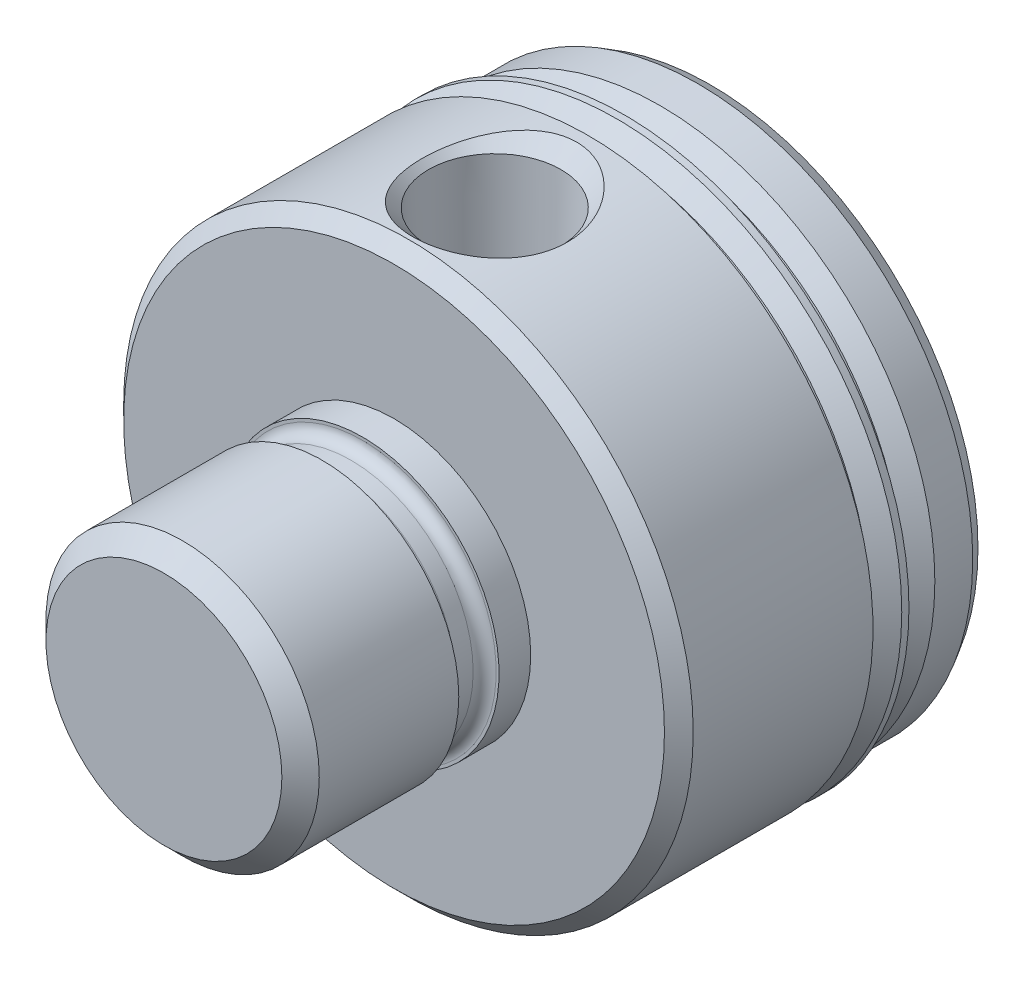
ISO-10303-21;
HEADER;
FILE_DESCRIPTION(('STEP AP214'),'2;1');
FILE_NAME('part.step','',(''),(''),'','','');
FILE_SCHEMA(('AUTOMOTIVE_DESIGN { 1 0 10303 214 1 1 1 1 }'));
ENDSEC;
DATA;
#1=APPLICATION_CONTEXT('core data for automotive mechanical design processes');
#2=APPLICATION_PROTOCOL_DEFINITION('international standard','automotive_design',2000,#1);
#3=PRODUCT_CONTEXT('',#1,'mechanical');
#4=PRODUCT('Part','Part','',(#3));
#5=PRODUCT_RELATED_PRODUCT_CATEGORY('part','',(#4));
#6=PRODUCT_DEFINITION_FORMATION('','',#4);
#7=PRODUCT_DEFINITION_CONTEXT('part definition',#1,'design');
#8=PRODUCT_DEFINITION('design','',#6,#7);
#9=PRODUCT_DEFINITION_SHAPE('','',#8);
#10=(LENGTH_UNIT() NAMED_UNIT(*) SI_UNIT(.MILLI.,.METRE.));
#11=(NAMED_UNIT(*) PLANE_ANGLE_UNIT() SI_UNIT($,.RADIAN.));
#12=(NAMED_UNIT(*) SI_UNIT($,.STERADIAN.) SOLID_ANGLE_UNIT());
#13=UNCERTAINTY_MEASURE_WITH_UNIT(LENGTH_MEASURE(1.E-05),#10,'distance_accuracy_value','');
#14=(GEOMETRIC_REPRESENTATION_CONTEXT(3) GLOBAL_UNCERTAINTY_ASSIGNED_CONTEXT((#13)) GLOBAL_UNIT_ASSIGNED_CONTEXT((#10,
#11,#12)) REPRESENTATION_CONTEXT('',''));
#15=CARTESIAN_POINT('',(0.,0.,0.));
#16=DIRECTION('',(0.,0.,1.));
#17=DIRECTION('',(1.,0.,0.));
#18=AXIS2_PLACEMENT_3D('',#15,#16,#17);
#19=CARTESIAN_POINT('',(0.,0.,22.));
#20=DIRECTION('',(0.,0.,-1.));
#21=DIRECTION('',(-1.,0.,0.));
#22=AXIS2_PLACEMENT_3D('',#19,#20,#21);
#23=CYLINDRICAL_SURFACE('',#22,19.8);
#24=CARTESIAN_POINT('',(0.,0.,21.));
#25=DIRECTION('',(0.,0.,1.));
#26=DIRECTION('',(1.,0.,0.));
#27=AXIS2_PLACEMENT_3D('',#24,#25,#26);
#28=CIRCLE('',#27,19.8);
#29=CARTESIAN_POINT('',(19.8,0.,21.));
#30=VERTEX_POINT('',#29);
#31=EDGE_CURVE('E75',#30,#30,#28,.F.);
#32=ORIENTED_EDGE('',*,*,#31,.T.);
#33=EDGE_LOOP('',(#32));
#34=FACE_BOUND('',#33,.T.);
#35=CARTESIAN_POINT('',(-4.23456118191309,19.341884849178,11.9103654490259));
#36=CARTESIAN_POINT('',(-4.07687664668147,19.3764070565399,11.6356817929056));
#37=CARTESIAN_POINT('',(-3.89702266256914,19.4137865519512,11.3739567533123));
#38=CARTESIAN_POINT('',(-3.49532950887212,19.4901095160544,10.8848210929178));
#39=CARTESIAN_POINT('',(-3.27346972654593,19.5290537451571,10.6574274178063));
#40=CARTESIAN_POINT('',(-2.79297257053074,19.6035193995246,10.2475499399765));
#41=CARTESIAN_POINT('',(-2.53455082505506,19.6390589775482,10.0648188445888));
#42=CARTESIAN_POINT('',(-1.98643303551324,19.7020226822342,9.75262714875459));
#43=CARTESIAN_POINT('',(-1.69677662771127,19.7294569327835,9.62310001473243));
#44=CARTESIAN_POINT('',(-1.13565186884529,19.7691365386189,9.43901851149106));
#45=CARTESIAN_POINT('',(-0.86678525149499,19.7829027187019,9.37685588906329));
#46=CARTESIAN_POINT('',(-0.321914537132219,19.7992522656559,9.30323045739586));
#47=CARTESIAN_POINT('',(-0.0459160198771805,19.8018441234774,9.2917291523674));
#48=CARTESIAN_POINT('',(0.474663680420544,19.795844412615,9.31861467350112));
#49=CARTESIAN_POINT('',(0.719536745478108,19.7883839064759,9.35195529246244));
#50=CARTESIAN_POINT('',(1.20011845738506,19.7650599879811,9.45806650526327));
#51=CARTESIAN_POINT('',(1.43582699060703,19.7491964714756,9.53083758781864));
#52=CARTESIAN_POINT('',(1.89433897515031,19.710529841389,9.71316702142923));
#53=CARTESIAN_POINT('',(2.11700503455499,19.6876647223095,9.82305501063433));
#54=CARTESIAN_POINT('',(2.54270663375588,19.6372267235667,10.0749502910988));
#55=CARTESIAN_POINT('',(2.74573573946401,19.609652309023,10.216968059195));
#56=CARTESIAN_POINT('',(3.14866109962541,19.5492098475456,10.5443432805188));
#57=CARTESIAN_POINT('',(3.34612297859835,19.516088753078,10.7326446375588));
#58=CARTESIAN_POINT('',(3.71078746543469,19.4500505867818,11.1365638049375));
#59=CARTESIAN_POINT('',(3.87797475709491,19.4171336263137,11.3521953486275));
#60=CARTESIAN_POINT('',(4.19953341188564,19.350304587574,11.8341579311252));
#61=CARTESIAN_POINT('',(4.34956148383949,19.3167995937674,12.1034484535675));
#62=CARTESIAN_POINT('',(4.60700813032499,19.2570239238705,12.6624255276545));
#63=CARTESIAN_POINT('',(4.71440976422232,19.2307561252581,12.9521201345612));
#64=CARTESIAN_POINT('',(4.8927078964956,19.1862110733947,13.5707534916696));
#65=CARTESIAN_POINT('',(4.95961440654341,19.1688280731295,13.9009135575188));
#66=CARTESIAN_POINT('',(5.04043159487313,19.1477359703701,14.5680906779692));
#67=CARTESIAN_POINT('',(5.05433347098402,19.144029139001,14.9051088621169));
#68=CARTESIAN_POINT('',(5.0285381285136,19.1508230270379,15.586654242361));
#69=CARTESIAN_POINT('',(4.98729522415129,19.1617334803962,15.9311202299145));
#70=CARTESIAN_POINT('',(4.84914881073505,19.1971555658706,16.6080519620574));
#71=CARTESIAN_POINT('',(4.75223634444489,19.2216693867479,16.9405157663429));
#72=CARTESIAN_POINT('',(4.50449080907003,19.2812266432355,17.5830524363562));
#73=CARTESIAN_POINT('',(4.35375852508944,19.3162503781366,17.8931658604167));
#74=CARTESIAN_POINT('',(4.0005180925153,19.3924832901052,18.4817494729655));
#75=CARTESIAN_POINT('',(3.79800693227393,19.433692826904,18.7602178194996));
#76=CARTESIAN_POINT('',(3.35421628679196,19.5150659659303,19.2636047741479));
#77=CARTESIAN_POINT('',(3.11495938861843,19.5551991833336,19.490301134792));
#78=CARTESIAN_POINT('',(2.59696129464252,19.6306906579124,19.8939270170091));
#79=CARTESIAN_POINT('',(2.31826241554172,19.6660539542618,20.0709092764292));
#80=CARTESIAN_POINT('',(1.76371813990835,19.7230146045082,20.3470656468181));
#81=CARTESIAN_POINT('',(1.49136009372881,19.7457390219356,20.452924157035));
#82=CARTESIAN_POINT('',(1.07133873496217,19.7714966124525,20.5712905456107));
#83=CARTESIAN_POINT('',(0.929406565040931,19.7786945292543,20.6040100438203));
#84=CARTESIAN_POINT('',(0.642926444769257,19.7900781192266,20.6555086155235));
#85=CARTESIAN_POINT('',(0.498378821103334,19.7942641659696,20.6742894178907));
#86=CARTESIAN_POINT('',(0.100595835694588,19.8013478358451,20.7060741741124));
#87=CARTESIAN_POINT('',(-0.154016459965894,19.8010070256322,20.7045515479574));
#88=CARTESIAN_POINT('',(-0.65884841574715,19.7906493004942,20.658066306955));
#89=CARTESIAN_POINT('',(-0.90906884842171,19.7806341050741,20.613111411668));
#90=CARTESIAN_POINT('',(-1.38927726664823,19.7526136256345,20.4846446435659));
#91=CARTESIAN_POINT('',(-1.61966828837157,19.7349050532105,20.4025603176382));
#92=CARTESIAN_POINT('',(-2.06448483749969,19.6933464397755,20.2040719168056));
#93=CARTESIAN_POINT('',(-2.27890688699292,19.669495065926,20.0876603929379));
#94=CARTESIAN_POINT('',(-2.70317102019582,19.6158602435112,19.8150829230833));
#95=CARTESIAN_POINT('',(-2.91148061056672,19.5857671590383,19.6566006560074));
#96=CARTESIAN_POINT('',(-3.3019879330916,19.5237305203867,19.3105587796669));
#97=CARTESIAN_POINT('',(-3.48417329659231,19.4917860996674,19.1229854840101));
#98=CARTESIAN_POINT('',(-3.84155983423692,19.4247157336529,18.698657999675));
#99=CARTESIAN_POINT('',(-4.01296031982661,19.3896986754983,18.4586839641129));
#100=CARTESIAN_POINT('',(-4.31782342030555,19.3240978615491,17.9552040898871));
#101=CARTESIAN_POINT('',(-4.45126908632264,19.2935160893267,17.6916878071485));
#102=CARTESIAN_POINT('',(-4.6909794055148,19.2367249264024,17.1181094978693));
#103=CARTESIAN_POINT('',(-4.79277456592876,19.2113400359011,16.8060900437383));
#104=CARTESIAN_POINT('',(-4.94654548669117,19.1723237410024,16.1692507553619));
#105=CARTESIAN_POINT('',(-4.9985027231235,19.1586967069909,15.844426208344));
#106=CARTESIAN_POINT('',(-5.05307244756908,19.1443820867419,15.174535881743));
#107=CARTESIAN_POINT('',(-5.05318210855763,19.144350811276,14.8292498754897));
#108=CARTESIAN_POINT('',(-4.99772462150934,19.1589032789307,14.1436098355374));
#109=CARTESIAN_POINT('',(-4.94218495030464,19.1734798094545,13.8032534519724));
#110=CARTESIAN_POINT('',(-4.79136155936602,19.2116525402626,13.1969593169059));
#111=CARTESIAN_POINT('',(-4.70500571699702,19.2331590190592,12.9286332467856));
#112=CARTESIAN_POINT('',(-4.49641280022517,19.2829921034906,12.4069406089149));
#113=CARTESIAN_POINT('',(-4.37417690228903,19.3113184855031,12.1535735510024));
#114=CARTESIAN_POINT('',(-4.23456118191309,19.341884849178,11.9103654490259));
#115=B_SPLINE_CURVE_WITH_KNOTS('',3,(#35,#36,#37,#38,#39,#40,#41,#42,#43,#44,#45,#46,#47,#48,
#49,#50,#51,#52,#53,#54,#55,#56,#57,#58,#59,#60,#61,#62,#63,#64,#65,#66,#67,#68,#69,#70,#71,#72,
#73,#74,#75,#76,#77,#78,#79,#80,#81,#82,#83,#84,#85,#86,#87,#88,#89,#90,#91,#92,#93,#94,#95,#96,
#97,#98,#99,#100,#101,#102,#103,#104,#105,#106,#107,#108,#109,#110,#111,#112,#113,#114),
.UNSPECIFIED.,.T.,.F.,(4,2,2,2,2,2,2,2,2,2,2,2,2,2,2,2,2,2,2,2,2,2,2,2,2,2,2,2,2,2,2,2,2,2,2,2,
2,2,2,4),(0.,0.954854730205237,1.91017923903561,2.86008786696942,3.80880495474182,
4.63301716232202,5.45660297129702,6.19484379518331,6.93309376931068,7.67808055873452,
8.42331062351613,9.24459612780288,10.0662959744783,10.9926353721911,11.9193425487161,
12.926692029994,13.9342087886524,14.9705660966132,16.0070902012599,17.0416833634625,
18.0763367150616,19.0668483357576,20.05630519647,20.9298988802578,21.3667608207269,
21.803568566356,22.5631889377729,23.3226743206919,24.0551594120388,24.7878035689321,
25.5750535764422,26.3626750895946,27.2499576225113,28.1376357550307,29.1208250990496,
30.1043797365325,31.135408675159,32.1659287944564,33.0113959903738,33.8568354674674),.UNSPECIFIED.);
#116=CARTESIAN_POINT('',(-4.23456118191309,19.341884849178,11.9103654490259));
#117=VERTEX_POINT('',#116);
#118=EDGE_CURVE('E51',#117,#117,#115,.T.);
#119=ORIENTED_EDGE('',*,*,#118,.T.);
#120=EDGE_LOOP('',(#119));
#121=FACE_BOUND('',#120,.T.);
#122=CARTESIAN_POINT('',(0.,0.,8.50000000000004));
#123=DIRECTION('',(0.,0.,-1.));
#124=DIRECTION('',(-1.,0.,0.));
#125=AXIS2_PLACEMENT_3D('',#122,#123,#124);
#126=CIRCLE('',#125,19.8);
#127=CARTESIAN_POINT('',(-19.8,0.,8.50000000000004));
#128=VERTEX_POINT('',#127);
#129=EDGE_CURVE('E45',#128,#128,#126,.T.);
#130=ORIENTED_EDGE('',*,*,#129,.F.);
#131=EDGE_LOOP('',(#130));
#132=FACE_BOUND('',#131,.T.);
#133=ADVANCED_FACE('F27',(#34,#121,#132),#23,.T.);
#134=CARTESIAN_POINT('',(0.,0.,22.));
#135=DIRECTION('',(0.,0.,1.));
#136=DIRECTION('',(1.,0.,0.));
#137=AXIS2_PLACEMENT_3D('',#134,#135,#136);
#138=PLANE('',#137);
#139=CARTESIAN_POINT('',(0.,0.,22.));
#140=DIRECTION('',(0.,0.,1.));
#141=DIRECTION('',(1.,0.,0.));
#142=AXIS2_PLACEMENT_3D('',#139,#140,#141);
#143=CIRCLE('',#142,18.8);
#144=CARTESIAN_POINT('',(18.8,0.,22.));
#145=VERTEX_POINT('',#144);
#146=EDGE_CURVE('E78',#145,#145,#143,.T.);
#147=ORIENTED_EDGE('',*,*,#146,.T.);
#148=EDGE_LOOP('',(#147));
#149=FACE_BOUND('',#148,.T.);
#150=CARTESIAN_POINT('',(0.,0.,22.));
#151=DIRECTION('',(0.,0.,1.));
#152=DIRECTION('',(1.,0.,0.));
#153=AXIS2_PLACEMENT_3D('',#150,#151,#152);
#154=CIRCLE('',#153,9.5);
#155=CARTESIAN_POINT('',(9.50000000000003,0.,22.));
#156=VERTEX_POINT('',#155);
#157=EDGE_CURVE('E65',#156,#156,#154,.T.);
#158=ORIENTED_EDGE('',*,*,#157,.F.);
#159=EDGE_LOOP('',(#158));
#160=FACE_BOUND('',#159,.T.);
#161=ADVANCED_FACE('F149',(#149,#160),#138,.T.);
#162=CARTESIAN_POINT('',(0.,0.,22.));
#163=DIRECTION('',(0.,0.,-1.));
#164=DIRECTION('',(-1.,0.,0.));
#165=AXIS2_PLACEMENT_3D('',#162,#163,#164);
#166=CONICAL_SURFACE('',#165,18.8,0.785398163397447);
#167=ORIENTED_EDGE('',*,*,#31,.F.);
#168=EDGE_LOOP('',(#167));
#169=FACE_BOUND('',#168,.T.);
#170=ORIENTED_EDGE('',*,*,#146,.F.);
#171=EDGE_LOOP('',(#170));
#172=FACE_BOUND('',#171,.T.);
#173=ADVANCED_FACE('F145',(#169,#172),#166,.T.);
#174=CARTESIAN_POINT('',(0.,0.,38.));
#175=DIRECTION('',(0.,0.,-1.));
#176=DIRECTION('',(-1.,0.,0.));
#177=AXIS2_PLACEMENT_3D('',#174,#175,#176);
#178=CYLINDRICAL_SURFACE('',#177,9.5);
#179=CARTESIAN_POINT('',(0.,0.,24.2));
#180=DIRECTION('',(0.,0.,-1.));
#181=DIRECTION('',(-1.,0.,0.));
#182=AXIS2_PLACEMENT_3D('',#179,#180,#181);
#183=CIRCLE('',#182,9.5);
#184=CARTESIAN_POINT('',(-9.5,0.,24.2));
#185=VERTEX_POINT('',#184);
#186=EDGE_CURVE('E66',#185,#185,#183,.T.);
#187=ORIENTED_EDGE('',*,*,#186,.T.);
#188=EDGE_LOOP('',(#187));
#189=FACE_BOUND('',#188,.T.);
#190=ORIENTED_EDGE('',*,*,#157,.T.);
#191=EDGE_LOOP('',(#190));
#192=FACE_BOUND('',#191,.T.);
#193=ADVANCED_FACE('F134',(#189,#192),#178,.T.);
#194=CARTESIAN_POINT('',(0.,13.5,27.));
#195=DIRECTION('',(0.,0.,1.));
#196=DIRECTION('',(1.,0.,0.));
#197=AXIS2_PLACEMENT_3D('',#194,#195,#196);
#198=PLANE('',#197);
#199=CARTESIAN_POINT('',(0.,0.,27.));
#200=DIRECTION('',(0.,0.,1.));
#201=DIRECTION('',(1.,0.,0.));
#202=AXIS2_PLACEMENT_3D('',#199,#200,#201);
#203=CIRCLE('',#202,9.3);
#204=CARTESIAN_POINT('',(9.30000000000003,0.,27.));
#205=VERTEX_POINT('',#204);
#206=EDGE_CURVE('E38',#205,#205,#203,.T.);
#207=ORIENTED_EDGE('',*,*,#206,.T.);
#208=EDGE_LOOP('',(#207));
#209=FACE_BOUND('',#208,.T.);
#210=CARTESIAN_POINT('',(0.,0.,27.));
#211=DIRECTION('',(0.,0.,1.));
#212=DIRECTION('',(1.,0.,0.));
#213=AXIS2_PLACEMENT_3D('',#210,#211,#212);
#214=CIRCLE('',#213,9.5);
#215=CARTESIAN_POINT('',(9.50000000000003,0.,27.));
#216=VERTEX_POINT('',#215);
#217=EDGE_CURVE('E62',#216,#216,#214,.T.);
#218=ORIENTED_EDGE('',*,*,#217,.F.);
#219=EDGE_LOOP('',(#218));
#220=FACE_BOUND('',#219,.T.);
#221=ADVANCED_FACE('F126',(#209,#220),#198,.F.);
#222=CARTESIAN_POINT('',(0.,13.5,24.2));
#223=DIRECTION('',(0.,0.,-1.));
#224=DIRECTION('',(-1.,0.,0.));
#225=AXIS2_PLACEMENT_3D('',#222,#223,#224);
#226=PLANE('',#225);
#227=CARTESIAN_POINT('',(0.,0.,24.2));
#228=DIRECTION('',(0.,0.,-1.));
#229=DIRECTION('',(-1.,0.,0.));
#230=AXIS2_PLACEMENT_3D('',#227,#228,#229);
#231=CIRCLE('',#230,9.3);
#232=CARTESIAN_POINT('',(-9.3,0.,24.2));
#233=VERTEX_POINT('',#232);
#234=EDGE_CURVE('E58',#233,#233,#231,.T.);
#235=ORIENTED_EDGE('',*,*,#234,.T.);
#236=EDGE_LOOP('',(#235));
#237=FACE_BOUND('',#236,.T.);
#238=ORIENTED_EDGE('',*,*,#186,.F.);
#239=EDGE_LOOP('',(#238));
#240=FACE_BOUND('',#239,.T.);
#241=ADVANCED_FACE('F122',(#237,#240),#226,.F.);
#242=CARTESIAN_POINT('',(0.,0.,0.));
#243=DIRECTION('',(0.,0.,-1.));
#244=DIRECTION('',(-1.,0.,0.));
#245=AXIS2_PLACEMENT_3D('',#242,#243,#244);
#246=CYLINDRICAL_SURFACE('',#245,8.5);
#247=CARTESIAN_POINT('',(0.,0.,25.));
#248=DIRECTION('',(0.,0.,-1.));
#249=DIRECTION('',(-1.,0.,0.));
#250=AXIS2_PLACEMENT_3D('',#247,#248,#249);
#251=CIRCLE('',#250,8.5);
#252=CARTESIAN_POINT('',(-8.49999999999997,0.,25.));
#253=VERTEX_POINT('',#252);
#254=EDGE_CURVE('E42',#253,#253,#251,.F.);
#255=ORIENTED_EDGE('',*,*,#254,.T.);
#256=EDGE_LOOP('',(#255));
#257=FACE_BOUND('',#256,.T.);
#258=CARTESIAN_POINT('',(0.,0.,26.2));
#259=DIRECTION('',(0.,0.,1.));
#260=DIRECTION('',(1.,0.,0.));
#261=AXIS2_PLACEMENT_3D('',#258,#259,#260);
#262=CIRCLE('',#261,8.5);
#263=CARTESIAN_POINT('',(8.50000000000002,0.,26.2));
#264=VERTEX_POINT('',#263);
#265=EDGE_CURVE('E55',#264,#264,#262,.F.);
#266=ORIENTED_EDGE('',*,*,#265,.T.);
#267=EDGE_LOOP('',(#266));
#268=FACE_BOUND('',#267,.T.);
#269=ADVANCED_FACE('F125',(#257,#268),#246,.T.);
#270=CARTESIAN_POINT('',(0.,0.,38.));
#271=DIRECTION('',(0.,0.,1.));
#272=DIRECTION('',(1.,0.,0.));
#273=AXIS2_PLACEMENT_3D('',#270,#271,#272);
#274=PLANE('',#273);
#275=CARTESIAN_POINT('',(0.,0.,38.));
#276=DIRECTION('',(0.,0.,1.));
#277=DIRECTION('',(1.,0.,0.));
#278=AXIS2_PLACEMENT_3D('',#275,#276,#277);
#279=CIRCLE('',#278,8.2);
#280=CARTESIAN_POINT('',(8.20000000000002,0.,38.));
#281=VERTEX_POINT('',#280);
#282=EDGE_CURVE('E72',#281,#281,#279,.T.);
#283=ORIENTED_EDGE('',*,*,#282,.T.);
#284=EDGE_LOOP('',(#283));
#285=FACE_BOUND('',#284,.T.);
#286=ADVANCED_FACE('F130',(#285),#274,.T.);
#287=CARTESIAN_POINT('',(0.,0.,38.));
#288=DIRECTION('',(0.,0.,-1.));
#289=DIRECTION('',(-1.,0.,0.));
#290=AXIS2_PLACEMENT_3D('',#287,#288,#289);
#291=CONICAL_SURFACE('',#290,8.2,0.785398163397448);
#292=CARTESIAN_POINT('',(0.,0.,36.7));
#293=DIRECTION('',(0.,0.,1.));
#294=DIRECTION('',(1.,0.,0.));
#295=AXIS2_PLACEMENT_3D('',#292,#293,#294);
#296=CIRCLE('',#295,9.5);
#297=CARTESIAN_POINT('',(9.50000000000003,0.,36.7));
#298=VERTEX_POINT('',#297);
#299=EDGE_CURVE('E61',#298,#298,#296,.F.);
#300=ORIENTED_EDGE('',*,*,#299,.F.);
#301=EDGE_LOOP('',(#300));
#302=FACE_BOUND('',#301,.T.);
#303=ORIENTED_EDGE('',*,*,#282,.F.);
#304=EDGE_LOOP('',(#303));
#305=FACE_BOUND('',#304,.T.);
#306=ADVANCED_FACE('F136',(#302,#305),#291,.T.);
#307=ORIENTED_EDGE('',*,*,#217,.T.);
#308=EDGE_LOOP('',(#307));
#309=FACE_BOUND('',#308,.T.);
#310=ORIENTED_EDGE('',*,*,#299,.T.);
#311=EDGE_LOOP('',(#310));
#312=FACE_BOUND('',#311,.T.);
#313=ADVANCED_FACE('F120',(#309,#312),#178,.T.);
#314=CARTESIAN_POINT('',(0.,0.,25.));
#315=DIRECTION('',(0.,0.,-1.));
#316=DIRECTION('',(-1.,0.,0.));
#317=AXIS2_PLACEMENT_3D('',#314,#315,#316);
#318=TOROIDAL_SURFACE('',#317,9.3,0.8);
#319=ORIENTED_EDGE('',*,*,#254,.F.);
#320=EDGE_LOOP('',(#319));
#321=FACE_BOUND('',#320,.T.);
#322=ORIENTED_EDGE('',*,*,#234,.F.);
#323=EDGE_LOOP('',(#322));
#324=FACE_BOUND('',#323,.T.);
#325=ADVANCED_FACE('F116',(#321,#324),#318,.F.);
#326=CARTESIAN_POINT('',(0.,0.,26.2));
#327=DIRECTION('',(0.,0.,1.));
#328=DIRECTION('',(1.,0.,0.));
#329=AXIS2_PLACEMENT_3D('',#326,#327,#328);
#330=TOROIDAL_SURFACE('',#329,9.3,0.8);
#331=ORIENTED_EDGE('',*,*,#206,.F.);
#332=EDGE_LOOP('',(#331));
#333=FACE_BOUND('',#332,.T.);
#334=ORIENTED_EDGE('',*,*,#265,.F.);
#335=EDGE_LOOP('',(#334));
#336=FACE_BOUND('',#335,.T.);
#337=ADVANCED_FACE('F103',(#333,#336),#330,.F.);
#338=CARTESIAN_POINT('',(0.,19.8,15.));
#339=DIRECTION('',(0.,1.,0.));
#340=DIRECTION('',(0.,0.,1.));
#341=AXIS2_PLACEMENT_3D('',#338,#339,#340);
#342=CONICAL_SURFACE('',#341,5.7,0.785398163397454);
#343=CARTESIAN_POINT('',(0.,18.7006083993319,15.));
#344=DIRECTION('',(0.,1.,0.));
#345=DIRECTION('',(-1.,0.,0.));
#346=AXIS2_PLACEMENT_3D('',#343,#344,#345);
#347=CIRCLE('',#346,4.60060839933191);
#348=CARTESIAN_POINT('',(-4.60060839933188,18.7006083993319,15.));
#349=VERTEX_POINT('',#348);
#350=EDGE_CURVE('E48',#349,#349,#347,.T.);
#351=ORIENTED_EDGE('',*,*,#350,.F.);
#352=EDGE_LOOP('',(#351));
#353=FACE_BOUND('',#352,.T.);
#354=ORIENTED_EDGE('',*,*,#118,.F.);
#355=EDGE_LOOP('',(#354));
#356=FACE_BOUND('',#355,.T.);
#357=ADVANCED_FACE('F97',(#353,#356),#342,.F.);
#358=CARTESIAN_POINT('',(0.,0.,0.));
#359=DIRECTION('',(0.,1.,0.));
#360=DIRECTION('',(0.,0.,1.));
#361=AXIS2_PLACEMENT_3D('',#358,#359,#360);
#362=PLANE('',#361);
#363=CARTESIAN_POINT('',(0.,0.,15.));
#364=DIRECTION('',(0.,1.,0.));
#365=DIRECTION('',(0.,0.,1.));
#366=AXIS2_PLACEMENT_3D('',#363,#364,#365);
#367=CIRCLE('',#366,3.9475687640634);
#368=CARTESIAN_POINT('',(0.,0.,18.9475687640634));
#369=VERTEX_POINT('',#368);
#370=EDGE_CURVE('E69',#369,#369,#367,.F.);
#371=ORIENTED_EDGE('',*,*,#370,.F.);
#372=EDGE_LOOP('',(#371));
#373=FACE_BOUND('',#372,.T.);
#374=ADVANCED_FACE('F102',(#373),#362,.T.);
#375=CARTESIAN_POINT('',(0.,19.8,15.));
#376=DIRECTION('',(0.,1.,0.));
#377=DIRECTION('',(-1.,0.,0.));
#378=AXIS2_PLACEMENT_3D('',#375,#376,#377);
#379=CONICAL_SURFACE('',#378,4.639,0.0349065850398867);
#380=ORIENTED_EDGE('',*,*,#350,.T.);
#381=EDGE_LOOP('',(#380));
#382=FACE_BOUND('',#381,.T.);
#383=ORIENTED_EDGE('',*,*,#370,.T.);
#384=EDGE_LOOP('',(#383));
#385=FACE_BOUND('',#384,.T.);
#386=ADVANCED_FACE('F109',(#382,#385),#379,.F.);
#387=CARTESIAN_POINT('',(0.,23.7,8.50000000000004));
#388=DIRECTION('',(0.,0.,-1.));
#389=DIRECTION('',(-1.,0.,0.));
#390=AXIS2_PLACEMENT_3D('',#387,#388,#389);
#391=PLANE('',#390);
#392=CARTESIAN_POINT('',(0.,0.,8.50000000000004));
#393=DIRECTION('',(0.,0.,1.));
#394=DIRECTION('',(1.,0.,0.));
#395=AXIS2_PLACEMENT_3D('',#392,#393,#394);
#396=CIRCLE('',#395,18.7);
#397=CARTESIAN_POINT('',(18.7,0.,8.50000000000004));
#398=VERTEX_POINT('',#397);
#399=EDGE_CURVE('E49',#398,#398,#396,.T.);
#400=ORIENTED_EDGE('',*,*,#399,.T.);
#401=EDGE_LOOP('',(#400));
#402=FACE_BOUND('',#401,.T.);
#403=ORIENTED_EDGE('',*,*,#129,.T.);
#404=EDGE_LOOP('',(#403));
#405=FACE_BOUND('',#404,.T.);
#406=ADVANCED_FACE('F105',(#402,#405),#391,.T.);
#407=CARTESIAN_POINT('',(0.,0.,0.));
#408=DIRECTION('',(0.,0.,1.));
#409=DIRECTION('',(1.,0.,0.));
#410=AXIS2_PLACEMENT_3D('',#407,#408,#409);
#411=CYLINDRICAL_SURFACE('',#410,18.7);
#412=CARTESIAN_POINT('',(0.,0.,7.60000000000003));
#413=DIRECTION('',(0.,0.,1.));
#414=DIRECTION('',(1.,0.,0.));
#415=AXIS2_PLACEMENT_3D('',#412,#413,#414);
#416=CIRCLE('',#415,18.7);
#417=CARTESIAN_POINT('',(18.7,0.,7.60000000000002));
#418=VERTEX_POINT('',#417);
#419=EDGE_CURVE('E185',#418,#418,#416,.T.);
#420=ORIENTED_EDGE('',*,*,#419,.T.);
#421=EDGE_LOOP('',(#420));
#422=FACE_BOUND('',#421,.T.);
#423=ORIENTED_EDGE('',*,*,#399,.F.);
#424=EDGE_LOOP('',(#423));
#425=FACE_BOUND('',#424,.T.);
#426=ADVANCED_FACE('F222',(#422,#425),#411,.T.);
#427=CARTESIAN_POINT('',(0.,0.,7.60000000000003));
#428=DIRECTION('',(0.,0.,-1.));
#429=DIRECTION('',(-1.,0.,0.));
#430=AXIS2_PLACEMENT_3D('',#427,#428,#429);
#431=CONICAL_SURFACE('',#430,18.7,0.78539816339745);
#432=CARTESIAN_POINT('',(0.,0.,6.50000000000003));
#433=DIRECTION('',(0.,0.,1.));
#434=DIRECTION('',(1.,0.,0.));
#435=AXIS2_PLACEMENT_3D('',#432,#433,#434);
#436=CIRCLE('',#435,19.8);
#437=CARTESIAN_POINT('',(19.8,0.,6.50000000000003));
#438=VERTEX_POINT('',#437);
#439=EDGE_CURVE('E183',#438,#438,#436,.T.);
#440=ORIENTED_EDGE('',*,*,#439,.T.);
#441=EDGE_LOOP('',(#440));
#442=FACE_BOUND('',#441,.T.);
#443=ORIENTED_EDGE('',*,*,#419,.F.);
#444=EDGE_LOOP('',(#443));
#445=FACE_BOUND('',#444,.T.);
#446=ADVANCED_FACE('F154',(#442,#445),#431,.T.);
#447=CARTESIAN_POINT('',(0.,0.,6.00000000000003));
#448=DIRECTION('',(0.,0.,1.));
#449=DIRECTION('',(1.,0.,0.));
#450=AXIS2_PLACEMENT_3D('',#447,#448,#449);
#451=PLANE('',#450);
#452=CARTESIAN_POINT('',(0.,0.,6.00000000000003));
#453=DIRECTION('',(0.,0.,1.));
#454=DIRECTION('',(1.,0.,0.));
#455=AXIS2_PLACEMENT_3D('',#452,#453,#454);
#456=CIRCLE('',#455,19.8);
#457=CARTESIAN_POINT('',(19.8,0.,6.00000000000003));
#458=VERTEX_POINT('',#457);
#459=EDGE_CURVE('E81',#458,#458,#456,.T.);
#460=ORIENTED_EDGE('',*,*,#459,.F.);
#461=EDGE_LOOP('',(#460));
#462=FACE_BOUND('',#461,.T.);
#463=CARTESIAN_POINT('',(0.,0.,6.00000000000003));
#464=DIRECTION('',(0.,0.,1.));
#465=DIRECTION('',(1.,0.,0.));
#466=AXIS2_PLACEMENT_3D('',#463,#464,#465);
#467=CIRCLE('',#466,18.);
#468=CARTESIAN_POINT('',(18.,0.,6.00000000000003));
#469=VERTEX_POINT('',#468);
#470=EDGE_CURVE('E195',#469,#469,#467,.T.);
#471=ORIENTED_EDGE('',*,*,#470,.T.);
#472=EDGE_LOOP('',(#471));
#473=FACE_BOUND('',#472,.T.);
#474=ADVANCED_FACE('F151',(#462,#473),#451,.F.);
#475=ORIENTED_EDGE('',*,*,#459,.T.);
#476=EDGE_LOOP('',(#475));
#477=FACE_BOUND('',#476,.T.);
#478=ORIENTED_EDGE('',*,*,#439,.F.);
#479=EDGE_LOOP('',(#478));
#480=FACE_BOUND('',#479,.T.);
#481=ADVANCED_FACE('F153',(#477,#480),#23,.T.);
#482=CARTESIAN_POINT('',(0.,0.,0.));
#483=DIRECTION('',(0.,0.,1.));
#484=DIRECTION('',(1.,0.,0.));
#485=AXIS2_PLACEMENT_3D('',#482,#483,#484);
#486=CYLINDRICAL_SURFACE('',#485,18.);
#487=CARTESIAN_POINT('',(0.,0.,4.60000000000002));
#488=DIRECTION('',(0.,0.,1.));
#489=DIRECTION('',(1.,0.,0.));
#490=AXIS2_PLACEMENT_3D('',#487,#488,#489);
#491=CIRCLE('',#490,18.);
#492=CARTESIAN_POINT('',(18.,0.,4.60000000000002));
#493=VERTEX_POINT('',#492);
#494=EDGE_CURVE('E186',#493,#493,#491,.T.);
#495=ORIENTED_EDGE('',*,*,#494,.T.);
#496=EDGE_LOOP('',(#495));
#497=FACE_BOUND('',#496,.T.);
#498=ORIENTED_EDGE('',*,*,#470,.F.);
#499=EDGE_LOOP('',(#498));
#500=FACE_BOUND('',#499,.T.);
#501=ADVANCED_FACE('F171',(#497,#500),#486,.T.);
#502=CARTESIAN_POINT('',(0.,0.,4.60000000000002));
#503=DIRECTION('',(0.,0.,-1.));
#504=DIRECTION('',(-1.,0.,0.));
#505=AXIS2_PLACEMENT_3D('',#502,#503,#504);
#506=CONICAL_SURFACE('',#505,18.,0.785398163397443);
#507=CARTESIAN_POINT('',(0.,0.,3.5));
#508=DIRECTION('',(0.,0.,1.));
#509=DIRECTION('',(1.,0.,0.));
#510=AXIS2_PLACEMENT_3D('',#507,#508,#509);
#511=CIRCLE('',#510,19.1);
#512=CARTESIAN_POINT('',(19.1,0.,3.5));
#513=VERTEX_POINT('',#512);
#514=EDGE_CURVE('E190',#513,#513,#511,.T.);
#515=ORIENTED_EDGE('',*,*,#514,.T.);
#516=EDGE_LOOP('',(#515));
#517=FACE_BOUND('',#516,.T.);
#518=ORIENTED_EDGE('',*,*,#494,.F.);
#519=EDGE_LOOP('',(#518));
#520=FACE_BOUND('',#519,.T.);
#521=ADVANCED_FACE('F176',(#517,#520),#506,.T.);
#522=CARTESIAN_POINT('',(0.,0.,0.));
#523=DIRECTION('',(0.,0.,1.));
#524=DIRECTION('',(1.,0.,0.));
#525=AXIS2_PLACEMENT_3D('',#522,#523,#524);
#526=PLANE('',#525);
#527=CARTESIAN_POINT('',(0.,0.,0.));
#528=DIRECTION('',(0.,0.,1.));
#529=DIRECTION('',(1.,0.,0.));
#530=AXIS2_PLACEMENT_3D('',#527,#528,#529);
#531=CIRCLE('',#530,18.6);
#532=CARTESIAN_POINT('',(18.6,0.,0.));
#533=VERTEX_POINT('',#532);
#534=EDGE_CURVE('E10',#533,#533,#531,.F.);
#535=ORIENTED_EDGE('',*,*,#534,.T.);
#536=EDGE_LOOP('',(#535));
#537=FACE_BOUND('',#536,.T.);
#538=CARTESIAN_POINT('',(0.,0.,0.));
#539=DIRECTION('',(0.,0.,-1.));
#540=DIRECTION('',(-1.,0.,0.));
#541=AXIS2_PLACEMENT_3D('',#538,#539,#540);
#542=CIRCLE('',#541,5.);
#543=CARTESIAN_POINT('',(-4.99999999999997,0.,0.));
#544=VERTEX_POINT('',#543);
#545=EDGE_CURVE('E201',#544,#544,#542,.T.);
#546=ORIENTED_EDGE('',*,*,#545,.F.);
#547=EDGE_LOOP('',(#546));
#548=FACE_BOUND('',#547,.T.);
#549=ADVANCED_FACE('F207',(#537,#548),#526,.F.);
#550=CARTESIAN_POINT('',(0.,0.,6.00000000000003));
#551=DIRECTION('',(0.,0.,-1.));
#552=DIRECTION('',(-1.,0.,0.));
#553=AXIS2_PLACEMENT_3D('',#550,#551,#552);
#554=CYLINDRICAL_SURFACE('',#553,19.1);
#555=CARTESIAN_POINT('',(0.,0.,0.866025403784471));
#556=DIRECTION('',(0.,0.,1.));
#557=DIRECTION('',(1.,0.,0.));
#558=AXIS2_PLACEMENT_3D('',#555,#556,#557);
#559=CIRCLE('',#558,19.1);
#560=CARTESIAN_POINT('',(19.1,0.,0.86602540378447));
#561=VERTEX_POINT('',#560);
#562=EDGE_CURVE('E34',#561,#561,#559,.T.);
#563=ORIENTED_EDGE('',*,*,#562,.T.);
#564=EDGE_LOOP('',(#563));
#565=FACE_BOUND('',#564,.T.);
#566=ORIENTED_EDGE('',*,*,#514,.F.);
#567=EDGE_LOOP('',(#566));
#568=FACE_BOUND('',#567,.T.);
#569=ADVANCED_FACE('F29',(#565,#568),#554,.T.);
#570=CARTESIAN_POINT('',(0.,0.,3.00000000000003));
#571=DIRECTION('',(0.,0.,-1.));
#572=DIRECTION('',(-1.,0.,0.));
#573=AXIS2_PLACEMENT_3D('',#570,#571,#572);
#574=CYLINDRICAL_SURFACE('',#573,5.);
#575=CARTESIAN_POINT('',(0.,0.,3.00000000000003));
#576=DIRECTION('',(0.,0.,-1.));
#577=DIRECTION('',(-1.,0.,0.));
#578=AXIS2_PLACEMENT_3D('',#575,#576,#577);
#579=CIRCLE('',#578,5.);
#580=CARTESIAN_POINT('',(-5.,0.,3.00000000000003));
#581=VERTEX_POINT('',#580);
#582=EDGE_CURVE('E198',#581,#581,#579,.T.);
#583=ORIENTED_EDGE('',*,*,#582,.F.);
#584=EDGE_LOOP('',(#583));
#585=FACE_BOUND('',#584,.T.);
#586=ORIENTED_EDGE('',*,*,#545,.T.);
#587=EDGE_LOOP('',(#586));
#588=FACE_BOUND('',#587,.T.);
#589=ADVANCED_FACE('F205',(#585,#588),#574,.F.);
#590=CARTESIAN_POINT('',(0.,0.,3.00000000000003));
#591=DIRECTION('',(0.,0.,-1.));
#592=DIRECTION('',(-1.,0.,0.));
#593=AXIS2_PLACEMENT_3D('',#590,#591,#592);
#594=PLANE('',#593);
#595=ORIENTED_EDGE('',*,*,#582,.T.);
#596=EDGE_LOOP('',(#595));
#597=FACE_BOUND('',#596,.T.);
#598=ADVANCED_FACE('F321',(#597),#594,.T.);
#599=CARTESIAN_POINT('',(0.,0.,0.866025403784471));
#600=DIRECTION('',(0.,0.,1.));
#601=DIRECTION('',(1.,0.,0.));
#602=AXIS2_PLACEMENT_3D('',#599,#600,#601);
#603=CONICAL_SURFACE('',#602,19.1,0.523598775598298);
#604=ORIENTED_EDGE('',*,*,#534,.F.);
#605=EDGE_LOOP('',(#604));
#606=FACE_BOUND('',#605,.T.);
#607=ORIENTED_EDGE('',*,*,#562,.F.);
#608=EDGE_LOOP('',(#607));
#609=FACE_BOUND('',#608,.T.);
#610=ADVANCED_FACE('F328',(#606,#609),#603,.T.);
#611=CLOSED_SHELL('',(#133,#161,#173,#193,#221,#241,#269,#286,#306,#313,#325,#337,#357,#374,
#386,#406,#426,#446,#474,#481,#501,#521,#549,#569,#589,#598,#610));
#612=MANIFOLD_SOLID_BREP('B2',#611);
#613=ADVANCED_BREP_SHAPE_REPRESENTATION('',(#18,#612),#14);
#614=SHAPE_DEFINITION_REPRESENTATION(#9,#613);
ENDSEC;
END-ISO-10303-21;
